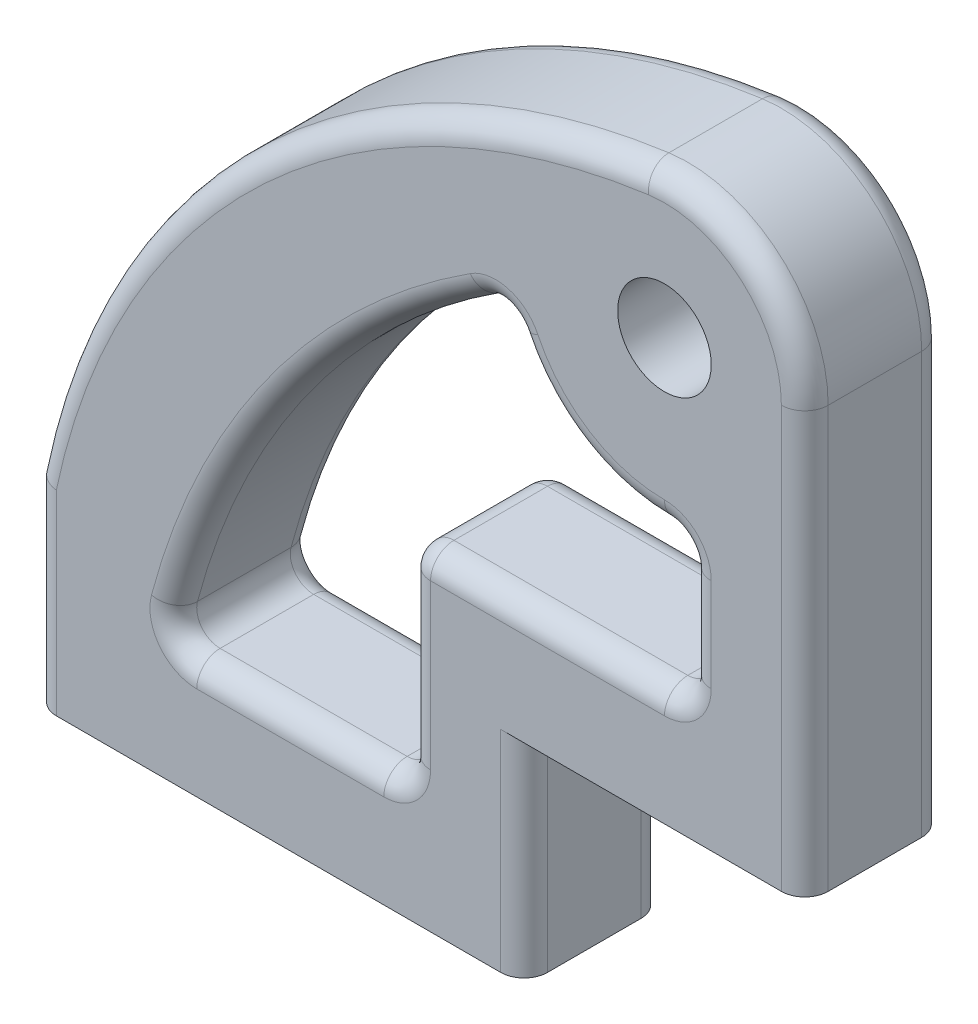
from build123d import *

# Parameters (mm, degrees)
SKETCH1_R                       = 4
BOSS_EXTRUDE1_DEPTH             = 12
FILLET1_R                       = 2
M6_TAPPED_HOLE4_D               = 5
M6_TAPPED_HOLE4_DEPTH           = 9.5
M6_TAPPED_HOLE4_ON_FACE_2_D     = 5
M6_TAPPED_HOLE4_ON_FACE_2_DEPTH = 9.5


with BuildPart() as part:
    # Sketch1 → Boss-Extrude1 (new body)
    with BuildSketch(Plane.XY):
        with BuildLine():
            Line((0, 0), (42, 0))
            Line((42, 0), (42, 18))
            Line((42, 18), (66, 18))
            Line((66, 18), (66, 54))
            ThreePointArc((66, 54), (61.893180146, 63.038678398), (52.383715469, 65.890652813))
            ThreePointArc((52.383715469, 65.890652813), (18.393420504, 49.746135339), (0, 16.91828621))
            Line((0, 16.91828621), (0, 0))
        make_face()
        with Locations((54, 54)):
            Circle(SKETCH1_R, mode=Mode.SUBTRACT)
        with BuildLine():
            Line((54, 28), (34, 28))
            ThreePointArc((34, 28), (32.585786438, 27.414213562), (32, 26))
            Line((32, 26), (32, 12))
            ThreePointArc((32, 12), (31.414213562, 10.585786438), (30, 10))
            Line((30, 10), (14.006182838, 10))
            ThreePointArc((14.006182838, 10), (12.420984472, 10.780513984), (12.073055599, 12.512853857))
            ThreePointArc((12.073055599, 12.512853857), (21.884733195, 33.117261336), (38.486359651, 48.776016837))
            ThreePointArc((38.486359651, 48.776016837), (40.113789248, 49.017313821), (41.371514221, 47.956710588))
            ThreePointArc((41.371514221, 47.956710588), (46.536959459, 42.155042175), (54, 40))
            ThreePointArc((54, 40), (55.414213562, 39.414213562), (56, 38))
            Line((56, 38), (56, 30))
            ThreePointArc((56, 30), (55.414213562, 28.585786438), (54, 28))
        make_face(mode=Mode.SUBTRACT)
    extrude(amount=BOSS_EXTRUDE1_DEPTH)

    # Fillet1
    fillet1_edges = [part.edges().sort_by_distance(p)[0] for p in [
        (55.414213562, 39.414213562, 0),
        (56, 34, 0),
        (55.414213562, 28.585786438, 0),
        (44, 28, 0),
        (32.585786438, 27.414213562, 0),
        (32, 19, 0),
        (31.414213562, 10.585786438, 0),
        (22.003091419, 10, 0),
        (12.420984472, 10.780513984, 0),
        (21.884733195, 33.117261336, 0),
        (40.113789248, 49.017313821, 0),
        (66, 36, 0),
        (61.893180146, 63.038678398, 0),
        (66, 36, 12),
        (61.893180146, 63.038678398, 12),
        (40.113789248, 49.017313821, 12),
        (46.536959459, 42.155042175, 12),
        (55.414213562, 39.414213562, 12),
        (56, 34, 12),
        (55.414213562, 28.585786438, 12),
        (44, 28, 12),
        (32.585786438, 27.414213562, 12),
        (32, 19, 12),
        (31.414213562, 10.585786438, 12),
        (22.003091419, 10, 12),
        (12.420984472, 10.780513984, 12),
        (42, 9, 0),
        (46.536959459, 42.155042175, 0),
        (18.393420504, 49.746135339, 0),
        (42, 9, 12),
        (18.393420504, 49.746135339, 12),
        (0, 8.459143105, 12),
        (21.884733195, 33.117261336, 12),
    ]]
    fillet(fillet1_edges, radius=FILLET1_R)

    # M6 Tapped Hole4
    with Locations(Plane(origin=(10, 0, 6), x_dir=(0, 0, -1), z_dir=(0, -1, 0))):
        with Locations((0, 0), (0, 22)):
            Hole(M6_TAPPED_HOLE4_D / 2, depth=M6_TAPPED_HOLE4_DEPTH)

    # M6 Tapped Hole4 on face 2
    with Locations(Plane(origin=(54, 18, 6), x_dir=(0, 0, -1), z_dir=(0, -1, 0))):
        with Locations((0, 0)):
            Hole(M6_TAPPED_HOLE4_ON_FACE_2_D / 2, depth=M6_TAPPED_HOLE4_ON_FACE_2_DEPTH)


solid = part.part
